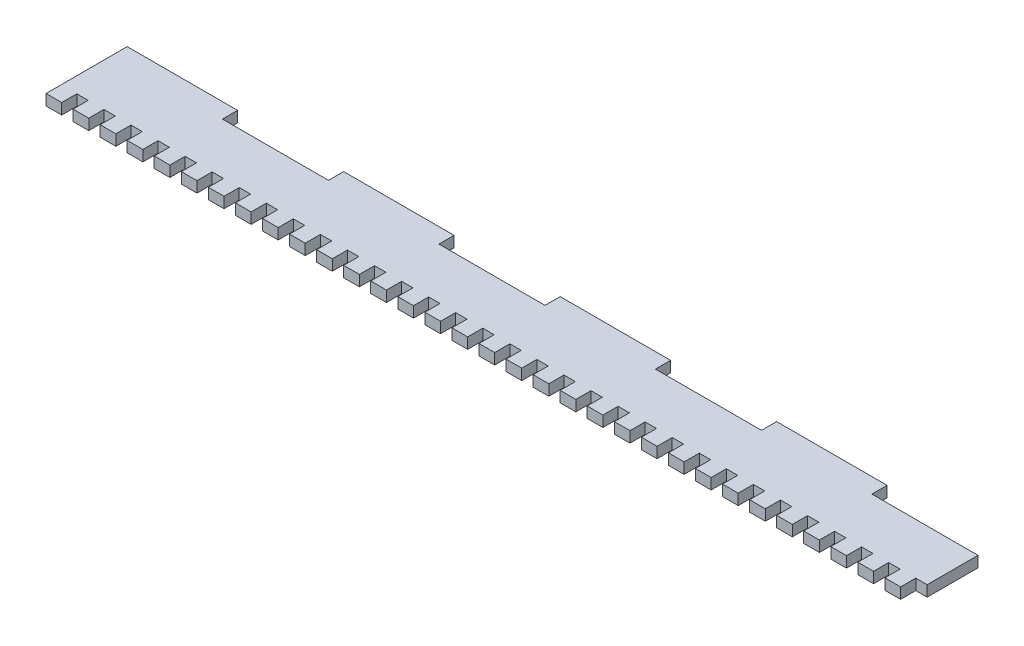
from build123d import *

# Parameters (mm, degrees)
BOSS_EXTRUDE1_DEPTH = 2.54


with BuildPart() as part:
    # Sketch1 → Boss-Extrude1 (new body)
    with BuildSketch(Plane(origin=(0, 0, 0), x_dir=(1, 0, 0), z_dir=(0, 1, 0))):
        Polygon((25.908, 19.05), (25.908, 15.494), (50.8, 15.494), (50.8, 19.05), (76.708, 19.05), (76.708, 15.494), (101.6, 15.494), (101.6, 19.05), (127.508, 19.05), (127.508, 15.494), (152.4, 15.494), (152.4, 19.05), (178.308, 19.05), (178.308, 15.494), (203.2, 15.494), (203.2, 3.556), (200.533, 3.556), (200.533, 0), (196.85, 0), (196.85, 3.556), (194.183, 3.556), (194.183, 0), (190.5, 0), (190.5, 3.556), (187.833, 3.556), (187.833, 0), (184.15, 0), (184.15, 3.556), (181.483, 3.556), (181.483, 0), (177.8, 0), (177.8, 3.556), (175.133, 3.556), (175.133, 0), (171.45, 0), (171.45, 3.556), (168.783, 3.556), (168.783, 0), (165.1, 0), (165.1, 3.556), (162.433, 3.556), (162.433, 0), (158.75, 0), (158.75, 3.556), (156.083, 3.556), (156.083, 0), (152.4, 0), (152.4, 3.556), (149.733, 3.556), (149.733, 0), (146.05, 0), (146.05, 3.556), (143.383, 3.556), (143.383, 0), (139.7, 0), (139.7, 3.556), (137.033, 3.556), (137.033, 0), (133.35, 0), (133.35, 3.556), (130.683, 3.556), (130.683, 0), (127, 0), (127, 3.556), (124.333, 3.556), (124.333, 0), (120.65, 0), (120.65, 3.556), (117.983, 3.556), (117.983, 0), (114.3, 0), (114.3, 3.556), (111.633, 3.556), (111.633, 0), (107.95, 0), (107.95, 3.556), (105.283, 3.556), (105.283, 0), (101.6, 0), (101.6, 3.556), (98.933, 3.556), (98.933, 0), (95.25, 0), (95.25, 3.556), (92.583, 3.556), (92.583, 0), (88.9, 0), (88.9, 3.556), (86.233, 3.556), (86.233, 0), (82.55, 0), (82.55, 3.556), (79.883, 3.556), (79.883, 0), (76.2, 0), (76.2, 3.556), (73.533, 3.556), (73.533, 0), (69.85, 0), (69.85, 3.556), (67.183, 3.556), (67.183, 0), (63.5, 0), (63.5, 3.556), (60.833, 3.556), (60.833, 0), (57.15, 0), (57.15, 3.556), (54.483, 3.556), (54.483, 0), (50.8, 0), (50.8, 3.556), (48.133, 3.556), (48.133, 0), (44.45, 0), (44.45, 3.556), (41.783, 3.556), (41.783, 0), (38.1, 0), (38.1, 3.556), (35.433, 3.556), (35.433, 0), (31.75, 0), (31.75, 3.556), (29.083, 3.556), (29.083, 0), (25.4, 0), (25.4, 3.556), (22.733, 3.556), (22.733, 0), (19.05, 0), (19.05, 3.556), (16.383, 3.556), (16.383, 0), (12.7, 0), (12.7, 3.556), (10.033, 3.556), (10.033, 0), (6.35, 0), (6.35, 3.556), (3.683, 3.556), (3.683, 0), (0, 0), (0, 19.05), align=None)
    extrude(amount=BOSS_EXTRUDE1_DEPTH)


solid = part.part
